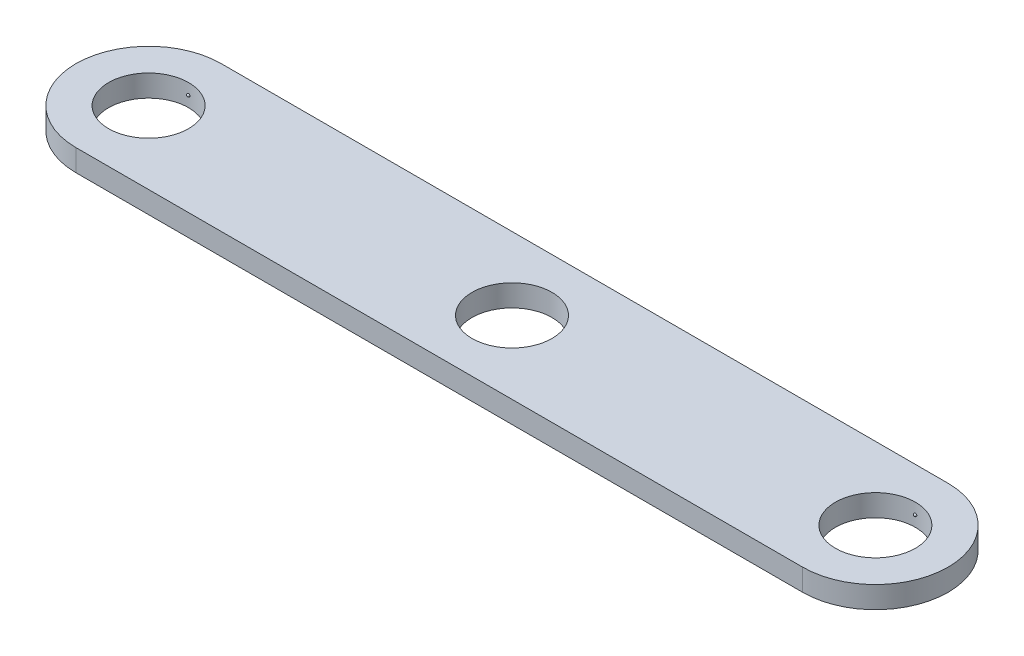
ISO-10303-21;
HEADER;
FILE_DESCRIPTION(('STEP AP214'),'2;1');
FILE_NAME('part.step','',(''),(''),'','','');
FILE_SCHEMA(('AUTOMOTIVE_DESIGN { 1 0 10303 214 1 1 1 1 }'));
ENDSEC;
DATA;
#1=APPLICATION_CONTEXT('core data for automotive mechanical design processes');
#2=APPLICATION_PROTOCOL_DEFINITION('international standard','automotive_design',2000,#1);
#3=PRODUCT_CONTEXT('',#1,'mechanical');
#4=PRODUCT('Part','Part','',(#3));
#5=PRODUCT_RELATED_PRODUCT_CATEGORY('part','',(#4));
#6=PRODUCT_DEFINITION_FORMATION('','',#4);
#7=PRODUCT_DEFINITION_CONTEXT('part definition',#1,'design');
#8=PRODUCT_DEFINITION('design','',#6,#7);
#9=PRODUCT_DEFINITION_SHAPE('','',#8);
#10=(LENGTH_UNIT() NAMED_UNIT(*) SI_UNIT(.MILLI.,.METRE.));
#11=(NAMED_UNIT(*) PLANE_ANGLE_UNIT() SI_UNIT($,.RADIAN.));
#12=(NAMED_UNIT(*) SI_UNIT($,.STERADIAN.) SOLID_ANGLE_UNIT());
#13=UNCERTAINTY_MEASURE_WITH_UNIT(LENGTH_MEASURE(1.E-05),#10,'distance_accuracy_value','');
#14=(GEOMETRIC_REPRESENTATION_CONTEXT(3) GLOBAL_UNCERTAINTY_ASSIGNED_CONTEXT((#13)) GLOBAL_UNIT_ASSIGNED_CONTEXT((#10,
#11,#12)) REPRESENTATION_CONTEXT('',''));
#15=CARTESIAN_POINT('',(0.,0.,0.));
#16=DIRECTION('',(0.,0.,1.));
#17=DIRECTION('',(1.,0.,0.));
#18=AXIS2_PLACEMENT_3D('',#15,#16,#17);
#19=CARTESIAN_POINT('',(50.,1.5,0.));
#20=DIRECTION('',(0.,-1.,0.));
#21=DIRECTION('',(0.,0.,-1.));
#22=AXIS2_PLACEMENT_3D('',#19,#20,#21);
#23=CYLINDRICAL_SURFACE('',#22,2.75);
#24=CARTESIAN_POINT('',(50.,0.,0.));
#25=DIRECTION('',(0.,1.,0.));
#26=DIRECTION('',(0.,0.,1.));
#27=AXIS2_PLACEMENT_3D('',#24,#25,#26);
#28=CIRCLE('',#27,2.75);
#29=CARTESIAN_POINT('',(50.,0.,2.75));
#30=VERTEX_POINT('',#29);
#31=EDGE_CURVE('E233',#30,#30,#28,.T.);
#32=ORIENTED_EDGE('',*,*,#31,.F.);
#33=EDGE_LOOP('',(#32));
#34=FACE_BOUND('',#33,.T.);
#35=CARTESIAN_POINT('',(50.,1.5,0.));
#36=DIRECTION('',(0.,1.,0.));
#37=DIRECTION('',(0.,0.,1.));
#38=AXIS2_PLACEMENT_3D('',#35,#36,#37);
#39=CIRCLE('',#38,2.75);
#40=CARTESIAN_POINT('',(50.,1.5,2.75));
#41=VERTEX_POINT('',#40);
#42=EDGE_CURVE('E236',#41,#41,#39,.T.);
#43=ORIENTED_EDGE('',*,*,#42,.T.);
#44=EDGE_LOOP('',(#43));
#45=FACE_BOUND('',#44,.T.);
#46=CARTESIAN_POINT('',(50.0999834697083,0.75,-2.74818181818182));
#47=CARTESIAN_POINT('',(50.099983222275,0.744383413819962,-2.74818184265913));
#48=CARTESIAN_POINT('',(50.0995089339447,0.738762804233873,-2.74819920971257));
#49=CARTESIAN_POINT('',(50.097623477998,0.72767645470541,-2.74826681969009));
#50=CARTESIAN_POINT('',(50.0962111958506,0.72221090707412,-2.74831710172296));
#51=CARTESIAN_POINT('',(50.0924898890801,0.711596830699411,-2.74844484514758));
#52=CARTESIAN_POINT('',(50.0901812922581,0.706448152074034,-2.7485222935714));
#53=CARTESIAN_POINT('',(50.0847333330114,0.696613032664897,-2.74869562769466));
#54=CARTESIAN_POINT('',(50.0815941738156,0.691926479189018,-2.74879150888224));
#55=CARTESIAN_POINT('',(50.0745731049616,0.683146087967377,-2.74899093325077));
#56=CARTESIAN_POINT('',(50.0706910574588,0.679052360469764,-2.74909447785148));
#57=CARTESIAN_POINT('',(50.0622944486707,0.671574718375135,-2.74929754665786));
#58=CARTESIAN_POINT('',(50.0577798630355,0.668190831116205,-2.74939707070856));
#59=CARTESIAN_POINT('',(50.0482466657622,0.662229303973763,-2.74958086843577));
#60=CARTESIAN_POINT('',(50.0432280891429,0.659651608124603,-2.74966514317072));
#61=CARTESIAN_POINT('',(50.0328290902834,0.655375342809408,-2.74980895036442));
#62=CARTESIAN_POINT('',(50.0274486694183,0.653676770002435,-2.74986848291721));
#63=CARTESIAN_POINT('',(50.0164805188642,0.651207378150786,-2.74995608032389));
#64=CARTESIAN_POINT('',(50.0108928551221,0.650436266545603,-2.74998415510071));
#65=CARTESIAN_POINT('',(49.9996673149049,0.649842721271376,-2.75000570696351));
#66=CARTESIAN_POINT('',(49.9940294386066,0.650020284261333,-2.74999918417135));
#67=CARTESIAN_POINT('',(49.9828650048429,0.651318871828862,-2.74995228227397));
#68=CARTESIAN_POINT('',(49.9773384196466,0.652439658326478,-2.74991191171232));
#69=CARTESIAN_POINT('',(49.9665519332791,0.655592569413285,-2.74980187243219));
#70=CARTESIAN_POINT('',(49.9612920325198,0.657624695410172,-2.74973220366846));
#71=CARTESIAN_POINT('',(49.9511874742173,0.662542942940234,-2.74957140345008));
#72=CARTESIAN_POINT('',(49.9463428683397,0.665429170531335,-2.74948026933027));
#73=CARTESIAN_POINT('',(49.9372069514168,0.671973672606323,-2.74928680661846));
#74=CARTESIAN_POINT('',(49.932915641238,0.675631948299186,-2.74918447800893));
#75=CARTESIAN_POINT('',(49.9250065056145,0.683618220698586,-2.74898011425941));
#76=CARTESIAN_POINT('',(49.9213889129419,0.687946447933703,-2.74887807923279));
#77=CARTESIAN_POINT('',(49.9149315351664,0.697148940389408,-2.7486858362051));
#78=CARTESIAN_POINT('',(49.9120917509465,0.702023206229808,-2.74859562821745));
#79=CARTESIAN_POINT('',(49.9072700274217,0.712180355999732,-2.7484371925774));
#80=CARTESIAN_POINT('',(49.9052882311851,0.717463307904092,-2.74836896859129));
#81=CARTESIAN_POINT('',(49.9022393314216,0.728287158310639,-2.74826221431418));
#82=CARTESIAN_POINT('',(49.9011722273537,0.733828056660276,-2.74822368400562));
#83=CARTESIAN_POINT('',(49.8999830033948,0.745009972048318,-2.74818066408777));
#84=CARTESIAN_POINT('',(49.8998607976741,0.750650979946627,-2.74817617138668));
#85=CARTESIAN_POINT('',(49.90056460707,0.761873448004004,-2.74820172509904));
#86=CARTESIAN_POINT('',(49.9013906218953,0.767454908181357,-2.74823177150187));
#87=CARTESIAN_POINT('',(49.9039673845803,0.778399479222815,-2.74832301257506));
#88=CARTESIAN_POINT('',(49.9057180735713,0.783762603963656,-2.7483842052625));
#89=CARTESIAN_POINT('',(49.9100945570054,0.794118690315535,-2.74853083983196));
#90=CARTESIAN_POINT('',(49.9127203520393,0.799111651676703,-2.74861628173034));
#91=CARTESIAN_POINT('',(49.9187729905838,0.808586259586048,-2.74880179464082));
#92=CARTESIAN_POINT('',(49.922199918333,0.813067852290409,-2.7489018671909));
#93=CARTESIAN_POINT('',(49.9297575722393,0.821391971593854,-2.74910535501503));
#94=CARTESIAN_POINT('',(49.9338882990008,0.825234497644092,-2.74920877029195));
#95=CARTESIAN_POINT('',(49.9427366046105,0.832171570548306,-2.74940729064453));
#96=CARTESIAN_POINT('',(49.9474542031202,0.835266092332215,-2.74950239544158));
#97=CARTESIAN_POINT('',(49.9573423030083,0.840619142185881,-2.74967356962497));
#98=CARTESIAN_POINT('',(49.962512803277,0.842877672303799,-2.74974963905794));
#99=CARTESIAN_POINT('',(49.9731585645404,0.846494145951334,-2.7498741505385));
#100=CARTESIAN_POINT('',(49.9786337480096,0.847852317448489,-2.74992259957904));
#101=CARTESIAN_POINT('',(49.9897345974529,0.849630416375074,-2.74998643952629));
#102=CARTESIAN_POINT('',(49.9953602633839,0.850050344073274,-2.75000183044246));
#103=CARTESIAN_POINT('',(50.0066004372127,0.84994004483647,-2.7499978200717));
#104=CARTESIAN_POINT('',(50.0122149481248,0.849410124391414,-2.74997843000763));
#105=CARTESIAN_POINT('',(50.0232752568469,0.847415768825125,-2.74990706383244));
#106=CARTESIAN_POINT('',(50.0287210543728,0.84595133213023,-2.74985508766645));
#107=CARTESIAN_POINT('',(50.0392894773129,0.842129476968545,-2.74972440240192));
#108=CARTESIAN_POINT('',(50.0444120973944,0.839772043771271,-2.74964569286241));
#109=CARTESIAN_POINT('',(50.0541886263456,0.834231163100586,-2.7494704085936));
#110=CARTESIAN_POINT('',(50.0588425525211,0.831047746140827,-2.74937383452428));
#111=CARTESIAN_POINT('',(50.0675509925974,0.823944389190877,-2.74917367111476));
#112=CARTESIAN_POINT('',(50.0716053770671,0.820024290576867,-2.74907008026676));
#113=CARTESIAN_POINT('',(50.0789996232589,0.811557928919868,-2.74886754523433));
#114=CARTESIAN_POINT('',(50.0823393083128,0.807011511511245,-2.7487686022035));
#115=CARTESIAN_POINT('',(50.0882103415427,0.797419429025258,-2.74858647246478));
#116=CARTESIAN_POINT('',(50.0907411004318,0.792373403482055,-2.7485032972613));
#117=CARTESIAN_POINT('',(50.0949169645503,0.781931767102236,-2.74836227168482));
#118=CARTESIAN_POINT('',(50.0965631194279,0.776536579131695,-2.74830439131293));
#119=CARTESIAN_POINT('',(50.0984886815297,0.767589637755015,-2.74823588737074));
#120=CARTESIAN_POINT('',(50.0990485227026,0.76409581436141,-2.74821569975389));
#121=CARTESIAN_POINT('',(50.0997959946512,0.757068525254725,-2.74818865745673));
#122=CARTESIAN_POINT('',(50.0999836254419,0.753535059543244,-2.74818180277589));
#123=CARTESIAN_POINT('',(50.0999834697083,0.75,-2.74818181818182));
#124=B_SPLINE_CURVE_WITH_KNOTS('',3,(#46,#47,#48,#49,#50,#51,#52,#53,#54,#55,#56,#57,#58,#59,
#60,#61,#62,#63,#64,#65,#66,#67,#68,#69,#70,#71,#72,#73,#74,#75,#76,#77,#78,#79,#80,#81,#82,#83,
#84,#85,#86,#87,#88,#89,#90,#91,#92,#93,#94,#95,#96,#97,#98,#99,#100,#101,#102,#103,#104,#105,
#106,#107,#108,#109,#110,#111,#112,#113,#114,#115,#116,#117,#118,#119,#120,#121,#122,#123),
.UNSPECIFIED.,.T.,.F.,(4,2,2,2,2,2,2,2,2,2,2,2,2,2,2,2,2,2,2,2,2,2,2,2,2,2,2,2,2,2,2,2,2,2,2,2,
2,2,4),(0.,0.0168368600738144,0.0336937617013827,0.0505426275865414,0.0673873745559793,
0.084235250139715,0.101083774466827,0.117931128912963,0.134778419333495,0.151620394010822,
0.168462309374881,0.185299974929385,0.202137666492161,0.218977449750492,0.23581725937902,
0.252662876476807,0.269508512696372,0.286356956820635,0.303205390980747,0.320052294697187,
0.336899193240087,0.353745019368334,0.370590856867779,0.387438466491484,0.404286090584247,
0.42113427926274,0.437982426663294,0.454826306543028,0.471670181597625,0.488508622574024,
0.505347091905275,0.522185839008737,0.53902396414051,0.555865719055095,0.57271163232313,
0.589569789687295,0.606407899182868,0.617004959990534,0.627602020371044),.UNSPECIFIED.);
#125=CARTESIAN_POINT('',(50.0999834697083,0.75,-2.74818181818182));
#126=VERTEX_POINT('',#125);
#127=EDGE_CURVE('E34',#126,#126,#124,.T.);
#128=ORIENTED_EDGE('',*,*,#127,.T.);
#129=EDGE_LOOP('',(#128));
#130=FACE_BOUND('',#129,.T.);
#131=ADVANCED_FACE('F30',(#34,#45,#130),#23,.F.);
#132=CARTESIAN_POINT('',(0.,1.5,0.));
#133=DIRECTION('',(0.,-1.,0.));
#134=DIRECTION('',(0.,0.,-1.));
#135=AXIS2_PLACEMENT_3D('',#132,#133,#134);
#136=CYLINDRICAL_SURFACE('',#135,2.75);
#137=CARTESIAN_POINT('',(0.,0.,0.));
#138=DIRECTION('',(0.,1.,0.));
#139=DIRECTION('',(0.,0.,1.));
#140=AXIS2_PLACEMENT_3D('',#137,#138,#139);
#141=CIRCLE('',#140,2.75);
#142=CARTESIAN_POINT('',(0.,0.,2.75));
#143=VERTEX_POINT('',#142);
#144=EDGE_CURVE('E120',#143,#143,#141,.T.);
#145=ORIENTED_EDGE('',*,*,#144,.F.);
#146=EDGE_LOOP('',(#145));
#147=FACE_BOUND('',#146,.T.);
#148=CARTESIAN_POINT('',(0.,1.5,0.));
#149=DIRECTION('',(0.,1.,0.));
#150=DIRECTION('',(0.,0.,1.));
#151=AXIS2_PLACEMENT_3D('',#148,#149,#150);
#152=CIRCLE('',#151,2.75);
#153=CARTESIAN_POINT('',(0.,1.5,2.75));
#154=VERTEX_POINT('',#153);
#155=EDGE_CURVE('E231',#154,#154,#152,.T.);
#156=ORIENTED_EDGE('',*,*,#155,.T.);
#157=EDGE_LOOP('',(#156));
#158=FACE_BOUND('',#157,.T.);
#159=CARTESIAN_POINT('',(0.0999834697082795,0.75,-2.74818181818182));
#160=CARTESIAN_POINT('',(0.0999832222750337,0.744383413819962,-2.74818184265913));
#161=CARTESIAN_POINT('',(0.0995089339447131,0.738762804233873,-2.74819920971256));
#162=CARTESIAN_POINT('',(0.0976234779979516,0.72767645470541,-2.74826681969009));
#163=CARTESIAN_POINT('',(0.0962111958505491,0.72221090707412,-2.74831710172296));
#164=CARTESIAN_POINT('',(0.0924898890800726,0.711596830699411,-2.74844484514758));
#165=CARTESIAN_POINT('',(0.0901812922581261,0.706448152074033,-2.7485222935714));
#166=CARTESIAN_POINT('',(0.0847333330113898,0.696613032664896,-2.74869562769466));
#167=CARTESIAN_POINT('',(0.0815941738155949,0.691926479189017,-2.74879150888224));
#168=CARTESIAN_POINT('',(0.0745731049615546,0.683146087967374,-2.74899093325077));
#169=CARTESIAN_POINT('',(0.0706910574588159,0.679052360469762,-2.74909447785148));
#170=CARTESIAN_POINT('',(0.0622944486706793,0.671574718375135,-2.74929754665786));
#171=CARTESIAN_POINT('',(0.0577798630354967,0.668190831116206,-2.74939707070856));
#172=CARTESIAN_POINT('',(0.0482466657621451,0.662229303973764,-2.74958086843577));
#173=CARTESIAN_POINT('',(0.0432280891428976,0.659651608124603,-2.74966514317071));
#174=CARTESIAN_POINT('',(0.0328290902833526,0.655375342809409,-2.74980895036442));
#175=CARTESIAN_POINT('',(0.0274486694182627,0.653676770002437,-2.74986848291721));
#176=CARTESIAN_POINT('',(0.0164805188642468,0.651207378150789,-2.74995608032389));
#177=CARTESIAN_POINT('',(0.0108928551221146,0.650436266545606,-2.74998415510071));
#178=CARTESIAN_POINT('',(-0.000332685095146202,0.649842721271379,-2.75000570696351));
#179=CARTESIAN_POINT('',(-0.00597056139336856,0.650020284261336,-2.74999918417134));
#180=CARTESIAN_POINT('',(-0.0171349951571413,0.651318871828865,-2.74995228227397));
#181=CARTESIAN_POINT('',(-0.0226615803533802,0.65243965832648,-2.74991191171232));
#182=CARTESIAN_POINT('',(-0.0334480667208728,0.655592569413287,-2.74980187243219));
#183=CARTESIAN_POINT('',(-0.0387079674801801,0.657624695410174,-2.74973220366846));
#184=CARTESIAN_POINT('',(-0.0488125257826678,0.662542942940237,-2.74957140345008));
#185=CARTESIAN_POINT('',(-0.0536571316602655,0.665429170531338,-2.74948026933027));
#186=CARTESIAN_POINT('',(-0.0627930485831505,0.671973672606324,-2.74928680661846));
#187=CARTESIAN_POINT('',(-0.0670843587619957,0.675631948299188,-2.74918447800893));
#188=CARTESIAN_POINT('',(-0.0749934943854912,0.683618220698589,-2.74898011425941));
#189=CARTESIAN_POINT('',(-0.0786110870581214,0.687946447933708,-2.74887807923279));
#190=CARTESIAN_POINT('',(-0.0850684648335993,0.697148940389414,-2.7486858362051));
#191=CARTESIAN_POINT('',(-0.0879082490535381,0.702023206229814,-2.74859562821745));
#192=CARTESIAN_POINT('',(-0.092729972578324,0.712180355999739,-2.7484371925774));
#193=CARTESIAN_POINT('',(-0.0947117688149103,0.717463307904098,-2.74836896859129));
#194=CARTESIAN_POINT('',(-0.0977606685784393,0.728287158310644,-2.74826221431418));
#195=CARTESIAN_POINT('',(-0.0988277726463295,0.73382805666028,-2.74822368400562));
#196=CARTESIAN_POINT('',(-0.100016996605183,0.745009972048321,-2.74818066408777));
#197=CARTESIAN_POINT('',(-0.100139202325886,0.75065097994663,-2.74817617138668));
#198=CARTESIAN_POINT('',(-0.0994353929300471,0.761873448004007,-2.74820172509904));
#199=CARTESIAN_POINT('',(-0.098609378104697,0.76745490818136,-2.74823177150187));
#200=CARTESIAN_POINT('',(-0.0960326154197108,0.778399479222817,-2.74832301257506));
#201=CARTESIAN_POINT('',(-0.0942819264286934,0.783762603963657,-2.7483842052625));
#202=CARTESIAN_POINT('',(-0.0899054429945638,0.794118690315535,-2.74853083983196));
#203=CARTESIAN_POINT('',(-0.0872796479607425,0.799111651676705,-2.74861628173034));
#204=CARTESIAN_POINT('',(-0.0812270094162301,0.808586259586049,-2.74880179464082));
#205=CARTESIAN_POINT('',(-0.0778000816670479,0.813067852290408,-2.7489018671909));
#206=CARTESIAN_POINT('',(-0.0702424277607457,0.821391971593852,-2.74910535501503));
#207=CARTESIAN_POINT('',(-0.0661117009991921,0.825234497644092,-2.74920877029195));
#208=CARTESIAN_POINT('',(-0.057263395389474,0.832171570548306,-2.74940729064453));
#209=CARTESIAN_POINT('',(-0.0525457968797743,0.835266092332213,-2.74950239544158));
#210=CARTESIAN_POINT('',(-0.0426576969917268,0.840619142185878,-2.74967356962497));
#211=CARTESIAN_POINT('',(-0.0374871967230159,0.842877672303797,-2.74974963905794));
#212=CARTESIAN_POINT('',(-0.0268414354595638,0.846494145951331,-2.7498741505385));
#213=CARTESIAN_POINT('',(-0.021366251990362,0.847852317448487,-2.74992259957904));
#214=CARTESIAN_POINT('',(-0.0102654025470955,0.849630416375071,-2.74998643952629));
#215=CARTESIAN_POINT('',(-0.00463973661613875,0.850050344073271,-2.75000183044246));
#216=CARTESIAN_POINT('',(0.00660043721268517,0.849940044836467,-2.7499978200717));
#217=CARTESIAN_POINT('',(0.0122149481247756,0.849410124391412,-2.74997843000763));
#218=CARTESIAN_POINT('',(0.0232752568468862,0.847415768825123,-2.74990706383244));
#219=CARTESIAN_POINT('',(0.0287210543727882,0.845951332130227,-2.74985508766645));
#220=CARTESIAN_POINT('',(0.0392894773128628,0.84212947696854,-2.74972440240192));
#221=CARTESIAN_POINT('',(0.0444120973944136,0.839772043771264,-2.74964569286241));
#222=CARTESIAN_POINT('',(0.0541886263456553,0.834231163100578,-2.7494704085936));
#223=CARTESIAN_POINT('',(0.0588425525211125,0.83104774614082,-2.74937383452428));
#224=CARTESIAN_POINT('',(0.0675509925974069,0.82394438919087,-2.74917367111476));
#225=CARTESIAN_POINT('',(0.0716053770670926,0.820024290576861,-2.74907008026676));
#226=CARTESIAN_POINT('',(0.078999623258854,0.811557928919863,-2.74886754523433));
#227=CARTESIAN_POINT('',(0.082339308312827,0.807011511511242,-2.7487686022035));
#228=CARTESIAN_POINT('',(0.0882103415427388,0.797419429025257,-2.74858647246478));
#229=CARTESIAN_POINT('',(0.0907411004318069,0.792373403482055,-2.7485032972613));
#230=CARTESIAN_POINT('',(0.0949169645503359,0.781931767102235,-2.74836227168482));
#231=CARTESIAN_POINT('',(0.096563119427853,0.776536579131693,-2.74830439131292));
#232=CARTESIAN_POINT('',(0.0984886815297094,0.767589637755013,-2.74823588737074));
#233=CARTESIAN_POINT('',(0.0990485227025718,0.764095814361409,-2.74821569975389));
#234=CARTESIAN_POINT('',(0.0997959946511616,0.757068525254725,-2.74818865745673));
#235=CARTESIAN_POINT('',(0.0999836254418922,0.753535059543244,-2.74818180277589));
#236=CARTESIAN_POINT('',(0.0999834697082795,0.75,-2.74818181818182));
#237=B_SPLINE_CURVE_WITH_KNOTS('',3,(#159,#160,#161,#162,#163,#164,#165,#166,#167,#168,#169,
#170,#171,#172,#173,#174,#175,#176,#177,#178,#179,#180,#181,#182,#183,#184,#185,#186,#187,#188,
#189,#190,#191,#192,#193,#194,#195,#196,#197,#198,#199,#200,#201,#202,#203,#204,#205,#206,#207,
#208,#209,#210,#211,#212,#213,#214,#215,#216,#217,#218,#219,#220,#221,#222,#223,#224,#225,#226,
#227,#228,#229,#230,#231,#232,#233,#234,#235,#236),.UNSPECIFIED.,.T.,.F.,(4,2,2,2,2,2,2,2,2,2,2,
2,2,2,2,2,2,2,2,2,2,2,2,2,2,2,2,2,2,2,2,2,2,2,2,2,2,2,4),(0.,0.016836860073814,
0.0336937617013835,0.0505426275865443,0.0673873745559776,0.0842352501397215,0.101083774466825,
0.117931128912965,0.134778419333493,0.151620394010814,0.168462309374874,0.185299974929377,
0.202137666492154,0.218977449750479,0.235817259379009,0.2526628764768,0.26950851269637,
0.286356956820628,0.303205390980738,0.320052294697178,0.336899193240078,0.353745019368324,
0.370590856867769,0.38743846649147,0.404286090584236,0.421134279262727,0.437982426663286,
0.454826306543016,0.471670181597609,0.488508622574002,0.505347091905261,0.522185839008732,
0.539023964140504,0.555865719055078,0.572711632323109,0.589569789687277,0.606407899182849,
0.617004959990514,0.627602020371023),.UNSPECIFIED.);
#238=CARTESIAN_POINT('',(0.0999834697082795,0.75,-2.74818181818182));
#239=VERTEX_POINT('',#238);
#240=EDGE_CURVE('E114',#239,#239,#237,.T.);
#241=ORIENTED_EDGE('',*,*,#240,.T.);
#242=EDGE_LOOP('',(#241));
#243=FACE_BOUND('',#242,.T.);
#244=ADVANCED_FACE('F121',(#147,#158,#243),#136,.F.);
#245=CARTESIAN_POINT('',(0.,1.5,0.));
#246=DIRECTION('',(0.,1.,0.));
#247=DIRECTION('',(0.,0.,1.));
#248=AXIS2_PLACEMENT_3D('',#245,#246,#247);
#249=PLANE('',#248);
#250=ORIENTED_EDGE('',*,*,#42,.F.);
#251=EDGE_LOOP('',(#250));
#252=FACE_BOUND('',#251,.T.);
#253=CARTESIAN_POINT('',(0.,1.5,0.));
#254=DIRECTION('',(0.,1.,0.));
#255=DIRECTION('',(0.,0.,1.));
#256=AXIS2_PLACEMENT_3D('',#253,#254,#255);
#257=CIRCLE('',#256,5.);
#258=CARTESIAN_POINT('',(0.,1.5,-5.));
#259=VERTEX_POINT('',#258);
#260=CARTESIAN_POINT('',(0.,1.5,5.));
#261=VERTEX_POINT('',#260);
#262=EDGE_CURVE('E105',#259,#261,#257,.T.);
#263=ORIENTED_EDGE('',*,*,#262,.T.);
#264=DIRECTION('',(1.,0.,0.));
#265=VECTOR('',#264,1.);
#266=CARTESIAN_POINT('',(0.,1.5,5.));
#267=LINE('',#266,#265);
#268=CARTESIAN_POINT('',(50.,1.5,5.));
#269=VERTEX_POINT('',#268);
#270=EDGE_CURVE('E90',#261,#269,#267,.T.);
#271=ORIENTED_EDGE('',*,*,#270,.T.);
#272=CARTESIAN_POINT('',(50.,1.5,0.));
#273=DIRECTION('',(0.,1.,0.));
#274=DIRECTION('',(0.,0.,1.));
#275=AXIS2_PLACEMENT_3D('',#272,#273,#274);
#276=CIRCLE('',#275,5.);
#277=CARTESIAN_POINT('',(50.,1.5,-5.));
#278=VERTEX_POINT('',#277);
#279=EDGE_CURVE('E56',#269,#278,#276,.T.);
#280=ORIENTED_EDGE('',*,*,#279,.T.);
#281=DIRECTION('',(-1.,0.,0.));
#282=VECTOR('',#281,1.);
#283=CARTESIAN_POINT('',(0.,1.5,-5.));
#284=LINE('',#283,#282);
#285=EDGE_CURVE('E51',#278,#259,#284,.T.);
#286=ORIENTED_EDGE('',*,*,#285,.T.);
#287=EDGE_LOOP('',(#263,#271,#280,#286));
#288=FACE_BOUND('',#287,.T.);
#289=CARTESIAN_POINT('',(25.,1.5,0.));
#290=DIRECTION('',(0.,1.,0.));
#291=DIRECTION('',(0.,0.,1.));
#292=AXIS2_PLACEMENT_3D('',#289,#290,#291);
#293=CIRCLE('',#292,2.75);
#294=CARTESIAN_POINT('',(25.,1.5,2.75));
#295=VERTEX_POINT('',#294);
#296=EDGE_CURVE('E95',#295,#295,#293,.T.);
#297=ORIENTED_EDGE('',*,*,#296,.F.);
#298=EDGE_LOOP('',(#297));
#299=FACE_BOUND('',#298,.T.);
#300=ORIENTED_EDGE('',*,*,#155,.F.);
#301=EDGE_LOOP('',(#300));
#302=FACE_BOUND('',#301,.T.);
#303=ADVANCED_FACE('F140',(#252,#288,#299,#302),#249,.T.);
#304=CARTESIAN_POINT('',(0.,0.,0.));
#305=DIRECTION('',(0.,1.,0.));
#306=DIRECTION('',(0.,0.,1.));
#307=AXIS2_PLACEMENT_3D('',#304,#305,#306);
#308=PLANE('',#307);
#309=ORIENTED_EDGE('',*,*,#31,.T.);
#310=EDGE_LOOP('',(#309));
#311=FACE_BOUND('',#310,.T.);
#312=CARTESIAN_POINT('',(0.,0.,0.));
#313=DIRECTION('',(0.,1.,0.));
#314=DIRECTION('',(0.,0.,1.));
#315=AXIS2_PLACEMENT_3D('',#312,#313,#314);
#316=CIRCLE('',#315,5.);
#317=CARTESIAN_POINT('',(0.,0.,-5.));
#318=VERTEX_POINT('',#317);
#319=CARTESIAN_POINT('',(0.,0.,5.));
#320=VERTEX_POINT('',#319);
#321=EDGE_CURVE('E82',#318,#320,#316,.T.);
#322=ORIENTED_EDGE('',*,*,#321,.F.);
#323=DIRECTION('',(-1.,0.,0.));
#324=VECTOR('',#323,1.);
#325=CARTESIAN_POINT('',(0.,0.,-5.));
#326=LINE('',#325,#324);
#327=CARTESIAN_POINT('',(50.,0.,-5.));
#328=VERTEX_POINT('',#327);
#329=EDGE_CURVE('E103',#328,#318,#326,.T.);
#330=ORIENTED_EDGE('',*,*,#329,.F.);
#331=CARTESIAN_POINT('',(50.,0.,0.));
#332=DIRECTION('',(0.,1.,0.));
#333=DIRECTION('',(0.,0.,1.));
#334=AXIS2_PLACEMENT_3D('',#331,#332,#333);
#335=CIRCLE('',#334,5.);
#336=CARTESIAN_POINT('',(50.,0.,5.));
#337=VERTEX_POINT('',#336);
#338=EDGE_CURVE('E83',#337,#328,#335,.T.);
#339=ORIENTED_EDGE('',*,*,#338,.F.);
#340=DIRECTION('',(1.,0.,0.));
#341=VECTOR('',#340,1.);
#342=CARTESIAN_POINT('',(0.,0.,5.));
#343=LINE('',#342,#341);
#344=EDGE_CURVE('E77',#320,#337,#343,.T.);
#345=ORIENTED_EDGE('',*,*,#344,.F.);
#346=EDGE_LOOP('',(#322,#330,#339,#345));
#347=FACE_BOUND('',#346,.T.);
#348=CARTESIAN_POINT('',(25.,0.,0.));
#349=DIRECTION('',(0.,1.,0.));
#350=DIRECTION('',(0.,0.,1.));
#351=AXIS2_PLACEMENT_3D('',#348,#349,#350);
#352=CIRCLE('',#351,2.75);
#353=CARTESIAN_POINT('',(25.,0.,2.75));
#354=VERTEX_POINT('',#353);
#355=EDGE_CURVE('E98',#354,#354,#352,.T.);
#356=ORIENTED_EDGE('',*,*,#355,.T.);
#357=EDGE_LOOP('',(#356));
#358=FACE_BOUND('',#357,.T.);
#359=ORIENTED_EDGE('',*,*,#144,.T.);
#360=EDGE_LOOP('',(#359));
#361=FACE_BOUND('',#360,.T.);
#362=ADVANCED_FACE('F78',(#311,#347,#358,#361),#308,.F.);
#363=CARTESIAN_POINT('',(0.,1.5,0.));
#364=DIRECTION('',(0.,-1.,0.));
#365=DIRECTION('',(0.,0.,-1.));
#366=AXIS2_PLACEMENT_3D('',#363,#364,#365);
#367=CYLINDRICAL_SURFACE('',#366,5.);
#368=ORIENTED_EDGE('',*,*,#321,.T.);
#369=DIRECTION('',(0.,-1.,0.));
#370=VECTOR('',#369,1.);
#371=CARTESIAN_POINT('',(0.,1.5,5.));
#372=LINE('',#371,#370);
#373=EDGE_CURVE('E11',#261,#320,#372,.T.);
#374=ORIENTED_EDGE('',*,*,#373,.F.);
#375=ORIENTED_EDGE('',*,*,#262,.F.);
#376=DIRECTION('',(0.,-1.,0.));
#377=VECTOR('',#376,1.);
#378=CARTESIAN_POINT('',(0.,1.5,-5.));
#379=LINE('',#378,#377);
#380=EDGE_CURVE('E94',#259,#318,#379,.T.);
#381=ORIENTED_EDGE('',*,*,#380,.T.);
#382=EDGE_LOOP('',(#368,#374,#375,#381));
#383=FACE_BOUND('',#382,.T.);
#384=ADVANCED_FACE('F32',(#383),#367,.T.);
#385=CARTESIAN_POINT('',(0.,1.5,5.));
#386=DIRECTION('',(0.,0.,-1.));
#387=DIRECTION('',(-1.,0.,0.));
#388=AXIS2_PLACEMENT_3D('',#385,#386,#387);
#389=PLANE('',#388);
#390=ORIENTED_EDGE('',*,*,#344,.T.);
#391=DIRECTION('',(0.,-1.,0.));
#392=VECTOR('',#391,1.);
#393=CARTESIAN_POINT('',(50.,1.5,5.));
#394=LINE('',#393,#392);
#395=EDGE_CURVE('E43',#269,#337,#394,.T.);
#396=ORIENTED_EDGE('',*,*,#395,.F.);
#397=ORIENTED_EDGE('',*,*,#270,.F.);
#398=ORIENTED_EDGE('',*,*,#373,.T.);
#399=EDGE_LOOP('',(#390,#396,#397,#398));
#400=FACE_BOUND('',#399,.T.);
#401=ADVANCED_FACE('F89',(#400),#389,.F.);
#402=CARTESIAN_POINT('',(50.,1.5,0.));
#403=DIRECTION('',(0.,-1.,0.));
#404=DIRECTION('',(0.,0.,-1.));
#405=AXIS2_PLACEMENT_3D('',#402,#403,#404);
#406=CYLINDRICAL_SURFACE('',#405,5.);
#407=ORIENTED_EDGE('',*,*,#338,.T.);
#408=DIRECTION('',(0.,-1.,0.));
#409=VECTOR('',#408,1.);
#410=CARTESIAN_POINT('',(50.,1.5,-5.));
#411=LINE('',#410,#409);
#412=EDGE_CURVE('E111',#278,#328,#411,.T.);
#413=ORIENTED_EDGE('',*,*,#412,.F.);
#414=ORIENTED_EDGE('',*,*,#279,.F.);
#415=ORIENTED_EDGE('',*,*,#395,.T.);
#416=EDGE_LOOP('',(#407,#413,#414,#415));
#417=FACE_BOUND('',#416,.T.);
#418=ADVANCED_FACE('F158',(#417),#406,.T.);
#419=CARTESIAN_POINT('',(0.,1.5,-5.));
#420=DIRECTION('',(0.,0.,1.));
#421=DIRECTION('',(1.,0.,0.));
#422=AXIS2_PLACEMENT_3D('',#419,#420,#421);
#423=PLANE('',#422);
#424=ORIENTED_EDGE('',*,*,#329,.T.);
#425=ORIENTED_EDGE('',*,*,#380,.F.);
#426=ORIENTED_EDGE('',*,*,#285,.F.);
#427=ORIENTED_EDGE('',*,*,#412,.T.);
#428=EDGE_LOOP('',(#424,#425,#426,#427));
#429=FACE_BOUND('',#428,.T.);
#430=ADVANCED_FACE('F148',(#429),#423,.F.);
#431=CARTESIAN_POINT('',(25.,1.5,0.));
#432=DIRECTION('',(0.,-1.,0.));
#433=DIRECTION('',(0.,0.,-1.));
#434=AXIS2_PLACEMENT_3D('',#431,#432,#433);
#435=CYLINDRICAL_SURFACE('',#434,2.75);
#436=ORIENTED_EDGE('',*,*,#296,.T.);
#437=EDGE_LOOP('',(#436));
#438=FACE_BOUND('',#437,.T.);
#439=ORIENTED_EDGE('',*,*,#355,.F.);
#440=EDGE_LOOP('',(#439));
#441=FACE_BOUND('',#440,.T.);
#442=ADVANCED_FACE('F127',(#438,#441),#435,.F.);
#443=CARTESIAN_POINT('',(0.,0.75,-2.75));
#444=DIRECTION('',(1.,0.,0.));
#445=DIRECTION('',(0.,0.,1.));
#446=AXIS2_PLACEMENT_3D('',#443,#444,#445);
#447=SPHERICAL_SURFACE('',#446,0.0999999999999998);
#448=ORIENTED_EDGE('',*,*,#240,.F.);
#449=EDGE_LOOP('',(#448));
#450=FACE_BOUND('',#449,.T.);
#451=ADVANCED_FACE('F123',(#450),#447,.T.);
#452=CARTESIAN_POINT('',(50.,0.75,-2.75));
#453=DIRECTION('',(1.,0.,0.));
#454=DIRECTION('',(0.,0.,1.));
#455=AXIS2_PLACEMENT_3D('',#452,#453,#454);
#456=SPHERICAL_SURFACE('',#455,0.100000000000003);
#457=ORIENTED_EDGE('',*,*,#127,.F.);
#458=EDGE_LOOP('',(#457));
#459=FACE_BOUND('',#458,.T.);
#460=ADVANCED_FACE('F126',(#459),#456,.T.);
#461=CLOSED_SHELL('',(#131,#244,#303,#362,#384,#401,#418,#430,#442,#451,#460));
#462=MANIFOLD_SOLID_BREP('B2',#461);
#463=ADVANCED_BREP_SHAPE_REPRESENTATION('',(#18,#462),#14);
#464=SHAPE_DEFINITION_REPRESENTATION(#9,#463);
ENDSEC;
END-ISO-10303-21;
